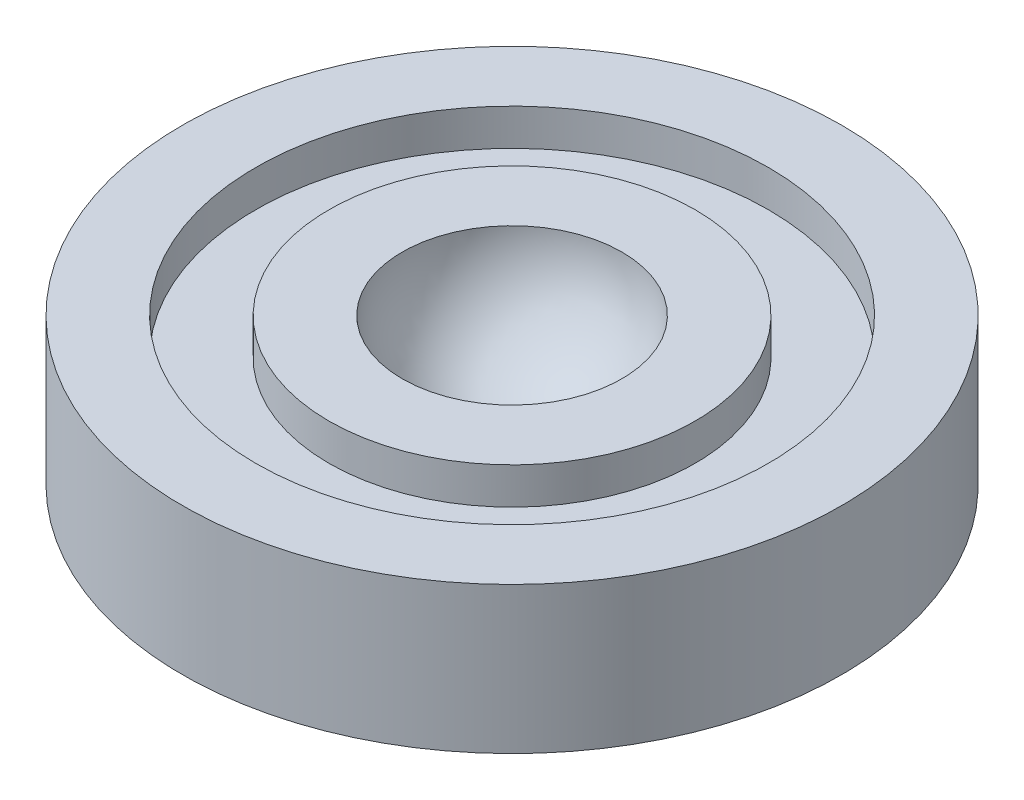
from build123d import *


with BuildPart() as part:
    # Skizze1 → Rotation1 (revolve)
    with BuildSketch(Plane(origin=(0, 0, 0), x_dir=(0, 0, -1), z_dir=(1, 0, 0)), mode=Mode.PRIVATE) as rotation1_sk:
        with BuildLine():
            Line((-15, 0), (-25, 0))
            Line((-25, 0), (-25, -5))
            Line((-25, -5), (-35, -5))
            Line((-35, -5), (-35, 0))
            Line((-35, 0), (-45, 0))
            Line((-45, 0), (-45, -13.14889336))
            Line((-45, -13.14889336), (-45, -20))
            Line((-45, -20), (0, -20))
            Line((0, -20), (0, -15))
            ThreePointArc((0, -15), (-10.606601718, -10.606601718), (-15, 0))
        make_face()
    revolve(rotation1_sk.sketch.rotate(Axis((0, 0, 0), (0, 1, 0)), 180), axis=Axis((0, 0, 0), (0, 1, 0)))


solid = part.part
